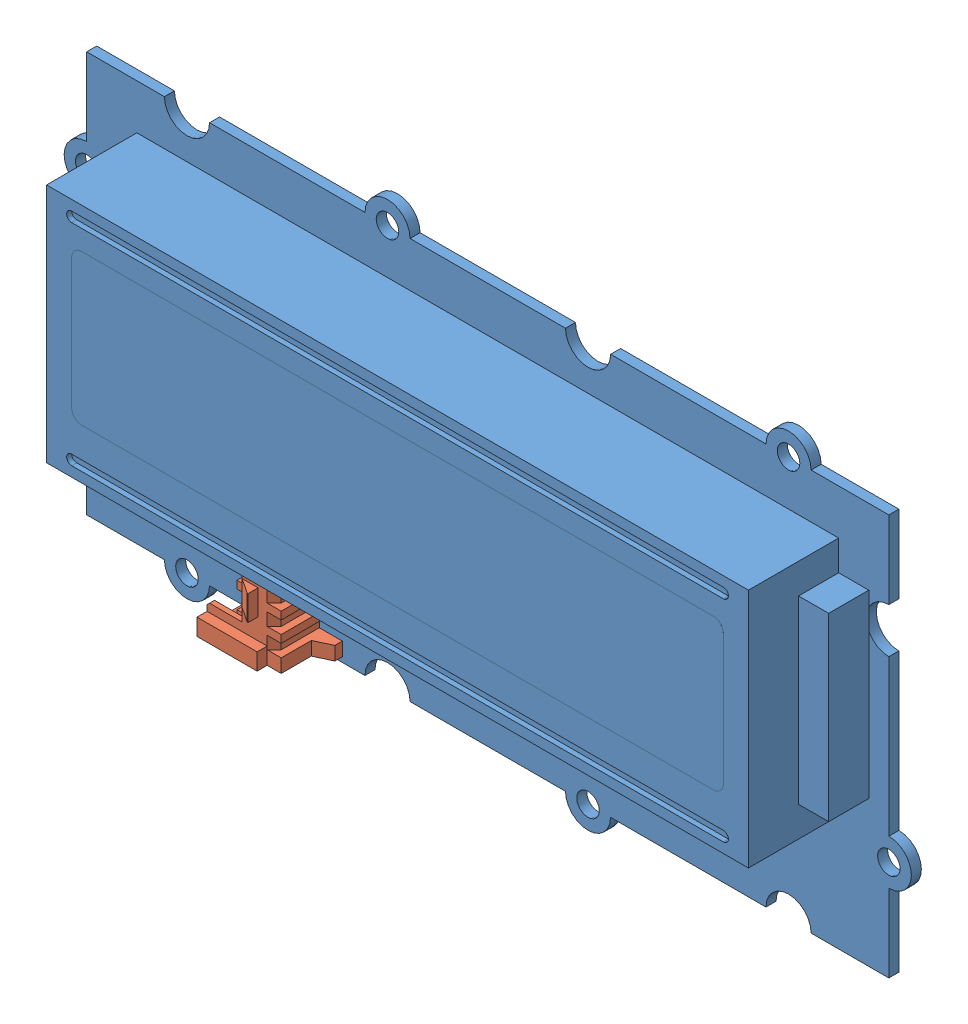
SolidWorks assembly Grove LCD RGB Backlight.SLDASM, configuration Défaut (file format 14000). Lengths in mm.
Overall size (84.5 44.5 10).
2 component instances, 2 part files, 3 mates.
Components (placement in the parent):
- LCD RGB Backlight-1: LCD RGB Backlight.SLDPRT [Défaut] at (-6.532 1.7619 75) size (84.5 44.5 10)
- Connecteur BSG-1: Connecteur BSG.SLDPRT [Défaut] at (-24.032 -12.7381 76) x (0 -1 0) z (-1 0 0) size (10 5.5 9)
Mates (geometry in assembly coordinates):
- Coïncidente5: coincident anti-aligned: plane of LCD RGB Backlight-1 through (-46.532 11.7619 76) normal (0 0 1); plane of Connecteur BSG-1 through (-30.032 -17.7381 76) normal (0 0 -1)
- Distance3: distance = 0.5 mm aligned: plane of Connecteur BSG-1 through (-30.032 -17.7381 76) normal (0 -1 0); plane of LCD RGB Backlight-1 through (-46.532 -18.2381 76) normal (0 -1 0)
- Distance4: distance = 16.5 mm aligned: plane of Connecteur BSG-1 through (-30.032 -12.7381 76) normal (-1 0 0); plane of LCD RGB Backlight-1 through (-46.532 21.7619 76) normal (-1 0 0)
